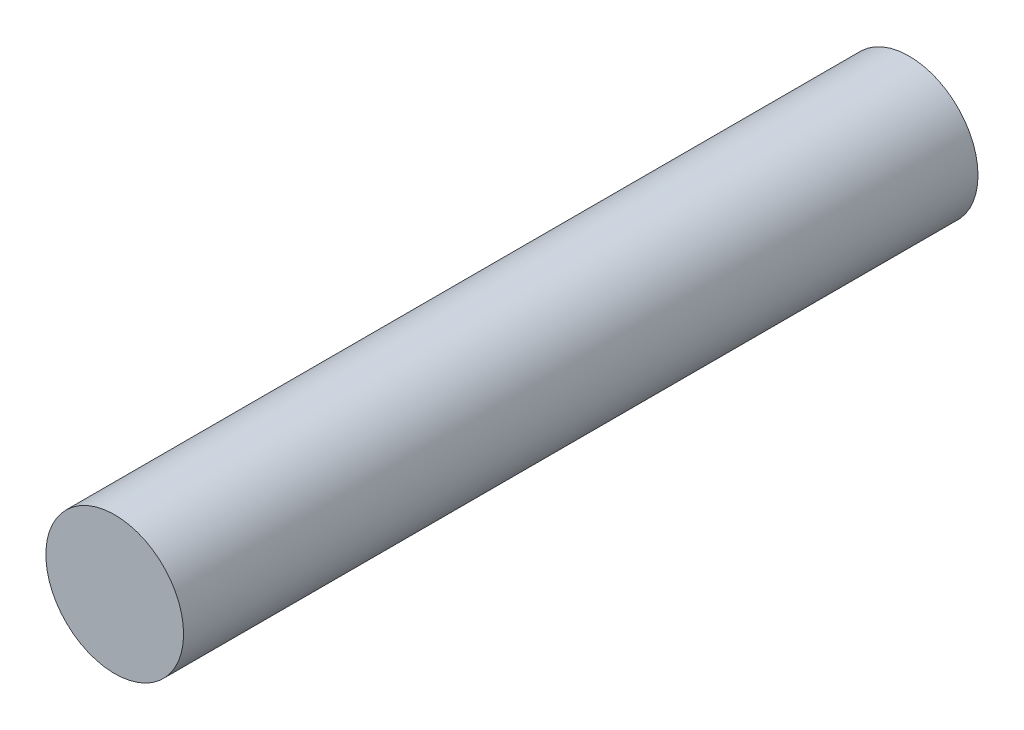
ISO-10303-21;
HEADER;
FILE_DESCRIPTION(('STEP AP214'),'2;1');
FILE_NAME('part.step','',(''),(''),'','','');
FILE_SCHEMA(('AUTOMOTIVE_DESIGN { 1 0 10303 214 1 1 1 1 }'));
ENDSEC;
DATA;
#1=APPLICATION_CONTEXT('core data for automotive mechanical design processes');
#2=APPLICATION_PROTOCOL_DEFINITION('international standard','automotive_design',2000,#1);
#3=PRODUCT_CONTEXT('',#1,'mechanical');
#4=PRODUCT('Part','Part','',(#3));
#5=PRODUCT_RELATED_PRODUCT_CATEGORY('part','',(#4));
#6=PRODUCT_DEFINITION_FORMATION('','',#4);
#7=PRODUCT_DEFINITION_CONTEXT('part definition',#1,'design');
#8=PRODUCT_DEFINITION('design','',#6,#7);
#9=PRODUCT_DEFINITION_SHAPE('','',#8);
#10=(LENGTH_UNIT() NAMED_UNIT(*) SI_UNIT(.MILLI.,.METRE.));
#11=(NAMED_UNIT(*) PLANE_ANGLE_UNIT() SI_UNIT($,.RADIAN.));
#12=(NAMED_UNIT(*) SI_UNIT($,.STERADIAN.) SOLID_ANGLE_UNIT());
#13=UNCERTAINTY_MEASURE_WITH_UNIT(LENGTH_MEASURE(1.E-05),#10,'distance_accuracy_value','');
#14=(GEOMETRIC_REPRESENTATION_CONTEXT(3) GLOBAL_UNCERTAINTY_ASSIGNED_CONTEXT((#13)) GLOBAL_UNIT_ASSIGNED_CONTEXT((#10,
#11,#12)) REPRESENTATION_CONTEXT('',''));
#15=CARTESIAN_POINT('',(0.,0.,0.));
#16=DIRECTION('',(0.,0.,1.));
#17=DIRECTION('',(1.,0.,0.));
#18=AXIS2_PLACEMENT_3D('',#15,#16,#17);
#19=CARTESIAN_POINT('',(0.,0.,1.));
#20=DIRECTION('',(0.,0.,1.));
#21=DIRECTION('',(1.,0.,0.));
#22=AXIS2_PLACEMENT_3D('',#19,#20,#21);
#23=PLANE('',#22);
#24=CARTESIAN_POINT('',(0.,0.,1.));
#25=DIRECTION('',(0.,0.,1.));
#26=DIRECTION('',(1.,0.,0.));
#27=AXIS2_PLACEMENT_3D('',#24,#25,#26);
#28=CIRCLE('',#27,0.259999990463);
#29=CARTESIAN_POINT('',(0.259999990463,0.,1.));
#30=VERTEX_POINT('',#29);
#31=EDGE_CURVE('E18',#30,#30,#28,.F.);
#32=ORIENTED_EDGE('',*,*,#31,.F.);
#33=EDGE_LOOP('',(#32));
#34=FACE_BOUND('',#33,.T.);
#35=ADVANCED_FACE('F15',(#34),#23,.T.);
#36=CARTESIAN_POINT('',(0.,0.,-2.));
#37=DIRECTION('',(0.,0.,1.));
#38=DIRECTION('',(1.,0.,0.));
#39=AXIS2_PLACEMENT_3D('',#36,#37,#38);
#40=PLANE('',#39);
#41=CARTESIAN_POINT('',(0.,0.,-2.));
#42=DIRECTION('',(0.,0.,1.));
#43=DIRECTION('',(1.,0.,0.));
#44=AXIS2_PLACEMENT_3D('',#41,#42,#43);
#45=CIRCLE('',#44,0.259999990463);
#46=CARTESIAN_POINT('',(0.259999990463,0.,-2.));
#47=VERTEX_POINT('',#46);
#48=EDGE_CURVE('E10',#47,#47,#45,.T.);
#49=ORIENTED_EDGE('',*,*,#48,.F.);
#50=EDGE_LOOP('',(#49));
#51=FACE_BOUND('',#50,.T.);
#52=ADVANCED_FACE('F30',(#51),#40,.F.);
#53=CARTESIAN_POINT('',(0.,0.,-2.));
#54=DIRECTION('',(0.,0.,1.));
#55=DIRECTION('',(1.,0.,0.));
#56=AXIS2_PLACEMENT_3D('',#53,#54,#55);
#57=CYLINDRICAL_SURFACE('',#56,0.259999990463);
#58=ORIENTED_EDGE('',*,*,#48,.T.);
#59=EDGE_LOOP('',(#58));
#60=FACE_BOUND('',#59,.T.);
#61=ORIENTED_EDGE('',*,*,#31,.T.);
#62=EDGE_LOOP('',(#61));
#63=FACE_BOUND('',#62,.T.);
#64=ADVANCED_FACE('F27',(#60,#63),#57,.T.);
#65=CLOSED_SHELL('',(#35,#52,#64));
#66=MANIFOLD_SOLID_BREP('B1',#65);
#67=ADVANCED_BREP_SHAPE_REPRESENTATION('',(#18,#66),#14);
#68=SHAPE_DEFINITION_REPRESENTATION(#9,#67);
ENDSEC;
END-ISO-10303-21;
